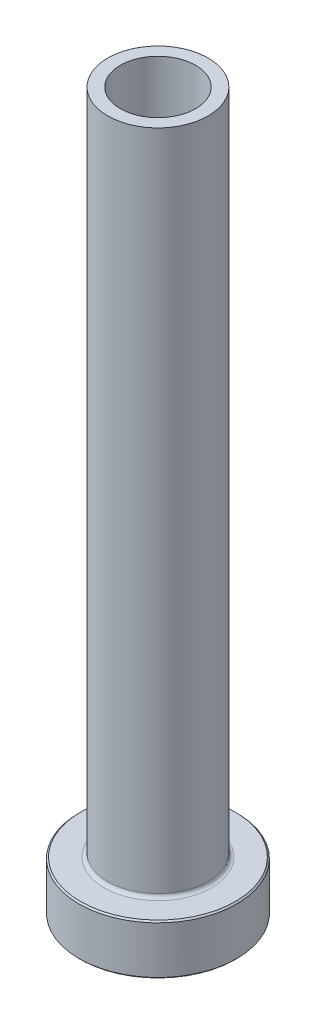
ISO-10303-21;
HEADER;
FILE_DESCRIPTION(('STEP AP214'),'2;1');
FILE_NAME('part.step','',(''),(''),'','','');
FILE_SCHEMA(('AUTOMOTIVE_DESIGN { 1 0 10303 214 1 1 1 1 }'));
ENDSEC;
DATA;
#1=APPLICATION_CONTEXT('core data for automotive mechanical design processes');
#2=APPLICATION_PROTOCOL_DEFINITION('international standard','automotive_design',2000,#1);
#3=PRODUCT_CONTEXT('',#1,'mechanical');
#4=PRODUCT('Part','Part','',(#3));
#5=PRODUCT_RELATED_PRODUCT_CATEGORY('part','',(#4));
#6=PRODUCT_DEFINITION_FORMATION('','',#4);
#7=PRODUCT_DEFINITION_CONTEXT('part definition',#1,'design');
#8=PRODUCT_DEFINITION('design','',#6,#7);
#9=PRODUCT_DEFINITION_SHAPE('','',#8);
#10=(LENGTH_UNIT() NAMED_UNIT(*) SI_UNIT(.MILLI.,.METRE.));
#11=(NAMED_UNIT(*) PLANE_ANGLE_UNIT() SI_UNIT($,.RADIAN.));
#12=(NAMED_UNIT(*) SI_UNIT($,.STERADIAN.) SOLID_ANGLE_UNIT());
#13=UNCERTAINTY_MEASURE_WITH_UNIT(LENGTH_MEASURE(1.E-05),#10,'distance_accuracy_value','');
#14=(GEOMETRIC_REPRESENTATION_CONTEXT(3) GLOBAL_UNCERTAINTY_ASSIGNED_CONTEXT((#13)) GLOBAL_UNIT_ASSIGNED_CONTEXT((#10,
#11,#12)) REPRESENTATION_CONTEXT('',''));
#15=CARTESIAN_POINT('',(0.,0.,0.));
#16=DIRECTION('',(0.,0.,1.));
#17=DIRECTION('',(1.,0.,0.));
#18=AXIS2_PLACEMENT_3D('',#15,#16,#17);
#19=CARTESIAN_POINT('',(0.,92.1876809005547,0.));
#20=DIRECTION('',(0.,1.,0.));
#21=DIRECTION('',(0.,0.,1.));
#22=AXIS2_PLACEMENT_3D('',#19,#20,#21);
#23=CYLINDRICAL_SURFACE('',#22,5.24999999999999);
#24=CARTESIAN_POINT('',(0.,100.,0.));
#25=DIRECTION('',(0.,1.,0.));
#26=DIRECTION('',(0.,0.,1.));
#27=AXIS2_PLACEMENT_3D('',#24,#25,#26);
#28=CIRCLE('',#27,5.24999999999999);
#29=CARTESIAN_POINT('',(0.,100.,5.24999999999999));
#30=VERTEX_POINT('',#29);
#31=EDGE_CURVE('E62',#30,#30,#28,.T.);
#32=ORIENTED_EDGE('',*,*,#31,.T.);
#33=EDGE_LOOP('',(#32));
#34=FACE_BOUND('',#33,.T.);
#35=CARTESIAN_POINT('',(0.,45.,0.));
#36=DIRECTION('',(0.,1.,0.));
#37=DIRECTION('',(0.,0.,1.));
#38=AXIS2_PLACEMENT_3D('',#35,#36,#37);
#39=CIRCLE('',#38,5.24999999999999);
#40=CARTESIAN_POINT('',(0.,45.,5.24999999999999));
#41=VERTEX_POINT('',#40);
#42=EDGE_CURVE('E71',#41,#41,#39,.T.);
#43=ORIENTED_EDGE('',*,*,#42,.F.);
#44=EDGE_LOOP('',(#43));
#45=FACE_BOUND('',#44,.T.);
#46=ADVANCED_FACE('F30',(#34,#45),#23,.F.);
#47=CARTESIAN_POINT('',(-5.24999999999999,100.,0.));
#48=DIRECTION('',(0.,1.,0.));
#49=DIRECTION('',(0.,0.,1.));
#50=AXIS2_PLACEMENT_3D('',#47,#48,#49);
#51=PLANE('',#50);
#52=CARTESIAN_POINT('',(0.,100.,0.));
#53=DIRECTION('',(0.,1.,0.));
#54=DIRECTION('',(0.,0.,1.));
#55=AXIS2_PLACEMENT_3D('',#52,#53,#54);
#56=CIRCLE('',#55,7.);
#57=CARTESIAN_POINT('',(0.,100.,7.));
#58=VERTEX_POINT('',#57);
#59=EDGE_CURVE('E65',#58,#58,#56,.T.);
#60=ORIENTED_EDGE('',*,*,#59,.T.);
#61=EDGE_LOOP('',(#60));
#62=FACE_BOUND('',#61,.T.);
#63=ORIENTED_EDGE('',*,*,#31,.F.);
#64=EDGE_LOOP('',(#63));
#65=FACE_BOUND('',#64,.T.);
#66=ADVANCED_FACE('F79',(#62,#65),#51,.T.);
#67=CARTESIAN_POINT('',(0.,92.1876809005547,0.));
#68=DIRECTION('',(0.,1.,0.));
#69=DIRECTION('',(0.,0.,1.));
#70=AXIS2_PLACEMENT_3D('',#67,#68,#69);
#71=CYLINDRICAL_SURFACE('',#70,7.);
#72=CARTESIAN_POINT('',(0.,7.50000000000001,0.));
#73=DIRECTION('',(0.,1.,0.));
#74=DIRECTION('',(0.,0.,1.));
#75=AXIS2_PLACEMENT_3D('',#72,#73,#74);
#76=CIRCLE('',#75,7.);
#77=CARTESIAN_POINT('',(0.,7.50000000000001,7.));
#78=VERTEX_POINT('',#77);
#79=EDGE_CURVE('E59',#78,#78,#76,.T.);
#80=ORIENTED_EDGE('',*,*,#79,.T.);
#81=EDGE_LOOP('',(#80));
#82=FACE_BOUND('',#81,.T.);
#83=ORIENTED_EDGE('',*,*,#59,.F.);
#84=EDGE_LOOP('',(#83));
#85=FACE_BOUND('',#84,.T.);
#86=ADVANCED_FACE('F85',(#82,#85),#71,.T.);
#87=CARTESIAN_POINT('',(-6.99999999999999,7.,0.));
#88=DIRECTION('',(0.,1.,0.));
#89=DIRECTION('',(0.,0.,1.));
#90=AXIS2_PLACEMENT_3D('',#87,#88,#89);
#91=PLANE('',#90);
#92=CARTESIAN_POINT('',(0.,7.,0.));
#93=DIRECTION('',(0.,1.,0.));
#94=DIRECTION('',(0.,0.,1.));
#95=AXIS2_PLACEMENT_3D('',#92,#93,#94);
#96=CIRCLE('',#95,10.8);
#97=CARTESIAN_POINT('',(0.,7.,10.8));
#98=VERTEX_POINT('',#97);
#99=EDGE_CURVE('E53',#98,#98,#96,.T.);
#100=ORIENTED_EDGE('',*,*,#99,.T.);
#101=EDGE_LOOP('',(#100));
#102=FACE_BOUND('',#101,.T.);
#103=CARTESIAN_POINT('',(0.,7.,0.));
#104=DIRECTION('',(0.,1.,0.));
#105=DIRECTION('',(0.,0.,1.));
#106=AXIS2_PLACEMENT_3D('',#103,#104,#105);
#107=CIRCLE('',#106,7.5);
#108=CARTESIAN_POINT('',(0.,7.,7.5));
#109=VERTEX_POINT('',#108);
#110=EDGE_CURVE('E56',#109,#109,#107,.F.);
#111=ORIENTED_EDGE('',*,*,#110,.T.);
#112=EDGE_LOOP('',(#111));
#113=FACE_BOUND('',#112,.T.);
#114=ADVANCED_FACE('F111',(#102,#113),#91,.T.);
#115=CARTESIAN_POINT('',(0.,92.1876809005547,0.));
#116=DIRECTION('',(0.,1.,0.));
#117=DIRECTION('',(0.,0.,1.));
#118=AXIS2_PLACEMENT_3D('',#115,#116,#117);
#119=CYLINDRICAL_SURFACE('',#118,11.);
#120=CARTESIAN_POINT('',(0.,6.80000000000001,0.));
#121=DIRECTION('',(0.,1.,0.));
#122=DIRECTION('',(0.,0.,1.));
#123=AXIS2_PLACEMENT_3D('',#120,#121,#122);
#124=CIRCLE('',#123,11.);
#125=CARTESIAN_POINT('',(0.,6.80000000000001,11.));
#126=VERTEX_POINT('',#125);
#127=EDGE_CURVE('E45',#126,#126,#124,.F.);
#128=ORIENTED_EDGE('',*,*,#127,.T.);
#129=EDGE_LOOP('',(#128));
#130=FACE_BOUND('',#129,.T.);
#131=CARTESIAN_POINT('',(0.,0.20000000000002,0.));
#132=DIRECTION('',(0.,-1.,0.));
#133=DIRECTION('',(0.,0.,-1.));
#134=AXIS2_PLACEMENT_3D('',#131,#132,#133);
#135=CIRCLE('',#134,11.);
#136=CARTESIAN_POINT('',(0.,0.20000000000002,-11.));
#137=VERTEX_POINT('',#136);
#138=EDGE_CURVE('E50',#137,#137,#135,.F.);
#139=ORIENTED_EDGE('',*,*,#138,.T.);
#140=EDGE_LOOP('',(#139));
#141=FACE_BOUND('',#140,.T.);
#142=ADVANCED_FACE('F108',(#130,#141),#119,.T.);
#143=CARTESIAN_POINT('',(-11.,0.,0.));
#144=DIRECTION('',(0.,-1.,0.));
#145=DIRECTION('',(0.,0.,-1.));
#146=AXIS2_PLACEMENT_3D('',#143,#144,#145);
#147=PLANE('',#146);
#148=CARTESIAN_POINT('',(0.,0.,0.));
#149=DIRECTION('',(0.,-1.,0.));
#150=DIRECTION('',(0.,0.,-1.));
#151=AXIS2_PLACEMENT_3D('',#148,#149,#150);
#152=CIRCLE('',#151,6.00000000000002);
#153=CARTESIAN_POINT('',(0.,0.,-6.00000000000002));
#154=VERTEX_POINT('',#153);
#155=EDGE_CURVE('E37',#154,#154,#152,.F.);
#156=ORIENTED_EDGE('',*,*,#155,.T.);
#157=EDGE_LOOP('',(#156));
#158=FACE_BOUND('',#157,.T.);
#159=CARTESIAN_POINT('',(0.,0.,0.));
#160=DIRECTION('',(0.,-1.,0.));
#161=DIRECTION('',(0.,0.,-1.));
#162=AXIS2_PLACEMENT_3D('',#159,#160,#161);
#163=CIRCLE('',#162,10.8);
#164=CARTESIAN_POINT('',(0.,0.,-10.8));
#165=VERTEX_POINT('',#164);
#166=EDGE_CURVE('E41',#165,#165,#163,.T.);
#167=ORIENTED_EDGE('',*,*,#166,.T.);
#168=EDGE_LOOP('',(#167));
#169=FACE_BOUND('',#168,.T.);
#170=ADVANCED_FACE('F110',(#158,#169),#147,.T.);
#171=CARTESIAN_POINT('',(0.,92.1876809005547,0.));
#172=DIRECTION('',(0.,1.,0.));
#173=DIRECTION('',(0.,0.,1.));
#174=AXIS2_PLACEMENT_3D('',#171,#172,#173);
#175=CYLINDRICAL_SURFACE('',#174,5.49999999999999);
#176=CARTESIAN_POINT('',(0.,0.500000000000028,0.));
#177=DIRECTION('',(0.,-1.,0.));
#178=DIRECTION('',(0.,0.,-1.));
#179=AXIS2_PLACEMENT_3D('',#176,#177,#178);
#180=CIRCLE('',#179,5.49999999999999);
#181=CARTESIAN_POINT('',(0.,0.500000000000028,-5.49999999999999));
#182=VERTEX_POINT('',#181);
#183=EDGE_CURVE('E10',#182,#182,#180,.T.);
#184=ORIENTED_EDGE('',*,*,#183,.T.);
#185=EDGE_LOOP('',(#184));
#186=FACE_BOUND('',#185,.T.);
#187=CARTESIAN_POINT('',(0.,33.,0.));
#188=DIRECTION('',(0.,1.,0.));
#189=DIRECTION('',(0.,0.,1.));
#190=AXIS2_PLACEMENT_3D('',#187,#188,#189);
#191=CIRCLE('',#190,5.5);
#192=CARTESIAN_POINT('',(0.,33.,5.5));
#193=VERTEX_POINT('',#192);
#194=EDGE_CURVE('E68',#193,#193,#191,.T.);
#195=ORIENTED_EDGE('',*,*,#194,.T.);
#196=EDGE_LOOP('',(#195));
#197=FACE_BOUND('',#196,.T.);
#198=ADVANCED_FACE('F118',(#186,#197),#175,.F.);
#199=CARTESIAN_POINT('',(0.,33.,0.));
#200=DIRECTION('',(0.,-1.,0.));
#201=DIRECTION('',(0.,0.,-1.));
#202=AXIS2_PLACEMENT_3D('',#199,#200,#201);
#203=CONICAL_SURFACE('',#202,5.5,0.0208303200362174);
#204=ORIENTED_EDGE('',*,*,#42,.T.);
#205=EDGE_LOOP('',(#204));
#206=FACE_BOUND('',#205,.T.);
#207=ORIENTED_EDGE('',*,*,#194,.F.);
#208=EDGE_LOOP('',(#207));
#209=FACE_BOUND('',#208,.T.);
#210=ADVANCED_FACE('F75',(#206,#209),#203,.F.);
#211=CARTESIAN_POINT('',(0.,7.50000000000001,0.));
#212=DIRECTION('',(0.,1.,0.));
#213=DIRECTION('',(0.,0.,1.));
#214=AXIS2_PLACEMENT_3D('',#211,#212,#213);
#215=TOROIDAL_SURFACE('',#214,7.5,0.5);
#216=ORIENTED_EDGE('',*,*,#110,.F.);
#217=EDGE_LOOP('',(#216));
#218=FACE_BOUND('',#217,.T.);
#219=ORIENTED_EDGE('',*,*,#79,.F.);
#220=EDGE_LOOP('',(#219));
#221=FACE_BOUND('',#220,.T.);
#222=ADVANCED_FACE('F90',(#218,#221),#215,.F.);
#223=CARTESIAN_POINT('',(0.,7.00000000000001,0.));
#224=DIRECTION('',(0.,-1.,0.));
#225=DIRECTION('',(0.,0.,-1.));
#226=AXIS2_PLACEMENT_3D('',#223,#224,#225);
#227=CONICAL_SURFACE('',#226,10.8,0.785398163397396);
#228=ORIENTED_EDGE('',*,*,#127,.F.);
#229=EDGE_LOOP('',(#228));
#230=FACE_BOUND('',#229,.T.);
#231=ORIENTED_EDGE('',*,*,#99,.F.);
#232=EDGE_LOOP('',(#231));
#233=FACE_BOUND('',#232,.T.);
#234=ADVANCED_FACE('F93',(#230,#233),#227,.T.);
#235=CARTESIAN_POINT('',(0.,0.20000000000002,0.));
#236=DIRECTION('',(0.,1.,0.));
#237=DIRECTION('',(0.,0.,1.));
#238=AXIS2_PLACEMENT_3D('',#235,#236,#237);
#239=CONICAL_SURFACE('',#238,11.,0.785398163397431);
#240=ORIENTED_EDGE('',*,*,#166,.F.);
#241=EDGE_LOOP('',(#240));
#242=FACE_BOUND('',#241,.T.);
#243=ORIENTED_EDGE('',*,*,#138,.F.);
#244=EDGE_LOOP('',(#243));
#245=FACE_BOUND('',#244,.T.);
#246=ADVANCED_FACE('F96',(#242,#245),#239,.T.);
#247=CARTESIAN_POINT('',(0.,0.,0.));
#248=DIRECTION('',(0.,-1.,0.));
#249=DIRECTION('',(0.,0.,-1.));
#250=AXIS2_PLACEMENT_3D('',#247,#248,#249);
#251=CONICAL_SURFACE('',#250,6.00000000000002,0.785398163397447);
#252=ORIENTED_EDGE('',*,*,#183,.F.);
#253=EDGE_LOOP('',(#252));
#254=FACE_BOUND('',#253,.T.);
#255=ORIENTED_EDGE('',*,*,#155,.F.);
#256=EDGE_LOOP('',(#255));
#257=FACE_BOUND('',#256,.T.);
#258=ADVANCED_FACE('F32',(#254,#257),#251,.F.);
#259=CLOSED_SHELL('',(#46,#66,#86,#114,#142,#170,#198,#210,#222,#234,#246,#258));
#260=MANIFOLD_SOLID_BREP('B2',#259);
#261=ADVANCED_BREP_SHAPE_REPRESENTATION('',(#18,#260),#14);
#262=SHAPE_DEFINITION_REPRESENTATION(#9,#261);
ENDSEC;
END-ISO-10303-21;
